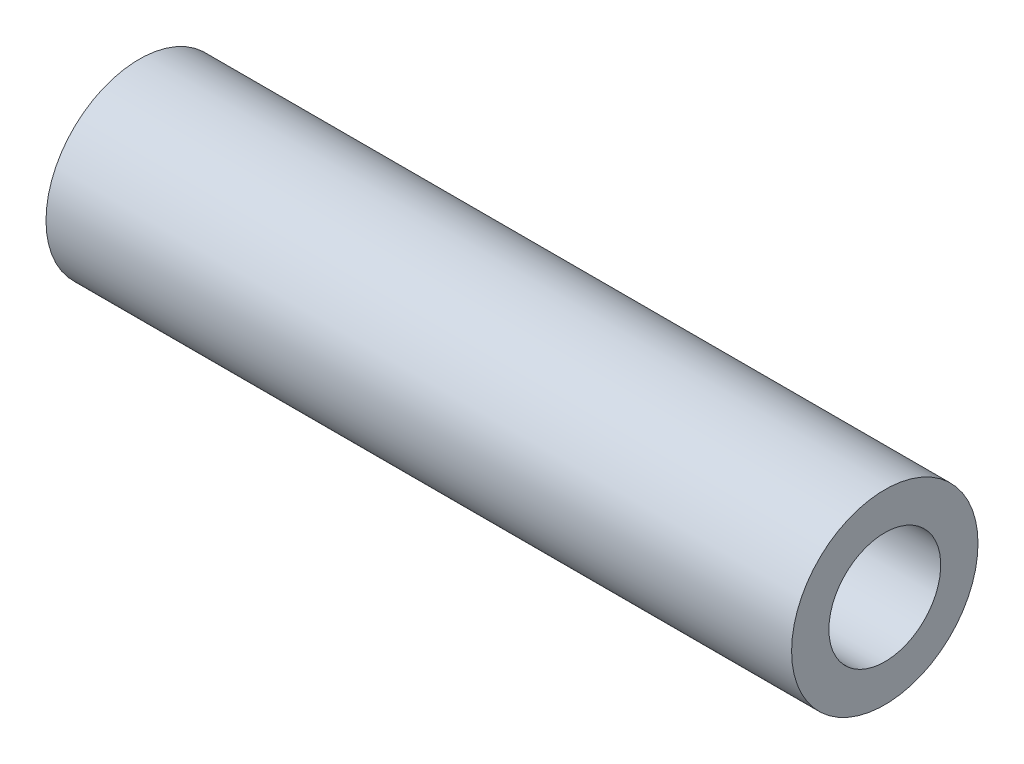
ISO-10303-21;
HEADER;
FILE_DESCRIPTION(('STEP AP214'),'2;1');
FILE_NAME('part.step','',(''),(''),'','','');
FILE_SCHEMA(('AUTOMOTIVE_DESIGN { 1 0 10303 214 1 1 1 1 }'));
ENDSEC;
DATA;
#1=APPLICATION_CONTEXT('core data for automotive mechanical design processes');
#2=APPLICATION_PROTOCOL_DEFINITION('international standard','automotive_design',2000,#1);
#3=PRODUCT_CONTEXT('',#1,'mechanical');
#4=PRODUCT('Part','Part','',(#3));
#5=PRODUCT_RELATED_PRODUCT_CATEGORY('part','',(#4));
#6=PRODUCT_DEFINITION_FORMATION('','',#4);
#7=PRODUCT_DEFINITION_CONTEXT('part definition',#1,'design');
#8=PRODUCT_DEFINITION('design','',#6,#7);
#9=PRODUCT_DEFINITION_SHAPE('','',#8);
#10=(LENGTH_UNIT() NAMED_UNIT(*) SI_UNIT(.MILLI.,.METRE.));
#11=(NAMED_UNIT(*) PLANE_ANGLE_UNIT() SI_UNIT($,.RADIAN.));
#12=(NAMED_UNIT(*) SI_UNIT($,.STERADIAN.) SOLID_ANGLE_UNIT());
#13=UNCERTAINTY_MEASURE_WITH_UNIT(LENGTH_MEASURE(1.E-05),#10,'distance_accuracy_value','');
#14=(GEOMETRIC_REPRESENTATION_CONTEXT(3) GLOBAL_UNCERTAINTY_ASSIGNED_CONTEXT((#13)) GLOBAL_UNIT_ASSIGNED_CONTEXT((#10,
#11,#12)) REPRESENTATION_CONTEXT('',''));
#15=CARTESIAN_POINT('',(0.,0.,0.));
#16=DIRECTION('',(0.,0.,1.));
#17=DIRECTION('',(1.,0.,0.));
#18=AXIS2_PLACEMENT_3D('',#15,#16,#17);
#19=CARTESIAN_POINT('',(0.,4.99999999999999,0.));
#20=DIRECTION('',(1.,0.,0.));
#21=DIRECTION('',(0.,0.,-1.));
#22=AXIS2_PLACEMENT_3D('',#19,#20,#21);
#23=PLANE('',#22);
#24=CARTESIAN_POINT('',(0.,-7.5,0.));
#25=DIRECTION('',(-1.,0.,0.));
#26=DIRECTION('',(0.,0.,1.));
#27=AXIS2_PLACEMENT_3D('',#24,#25,#26);
#28=CIRCLE('',#27,7.5);
#29=CARTESIAN_POINT('',(0.,-7.5,7.5));
#30=VERTEX_POINT('',#29);
#31=EDGE_CURVE('E10',#30,#30,#28,.T.);
#32=ORIENTED_EDGE('',*,*,#31,.F.);
#33=EDGE_LOOP('',(#32));
#34=FACE_BOUND('',#33,.T.);
#35=CARTESIAN_POINT('',(0.,-7.5,0.));
#36=DIRECTION('',(-1.,0.,0.));
#37=DIRECTION('',(0.,0.,1.));
#38=AXIS2_PLACEMENT_3D('',#35,#36,#37);
#39=CIRCLE('',#38,12.5);
#40=CARTESIAN_POINT('',(0.,-7.5,12.5));
#41=VERTEX_POINT('',#40);
#42=EDGE_CURVE('E43',#41,#41,#39,.T.);
#43=ORIENTED_EDGE('',*,*,#42,.T.);
#44=EDGE_LOOP('',(#43));
#45=FACE_BOUND('',#44,.T.);
#46=ADVANCED_FACE('F29',(#34,#45),#23,.F.);
#47=CARTESIAN_POINT('',(0.,-7.5,0.));
#48=DIRECTION('',(-1.,0.,0.));
#49=DIRECTION('',(0.,0.,1.));
#50=AXIS2_PLACEMENT_3D('',#47,#48,#49);
#51=CYLINDRICAL_SURFACE('',#50,7.5);
#52=CARTESIAN_POINT('',(100.,-7.5,0.));
#53=DIRECTION('',(-1.,0.,0.));
#54=DIRECTION('',(0.,0.,1.));
#55=AXIS2_PLACEMENT_3D('',#52,#53,#54);
#56=CIRCLE('',#55,7.5);
#57=CARTESIAN_POINT('',(100.,-7.5,7.5));
#58=VERTEX_POINT('',#57);
#59=EDGE_CURVE('E35',#58,#58,#56,.T.);
#60=ORIENTED_EDGE('',*,*,#59,.F.);
#61=EDGE_LOOP('',(#60));
#62=FACE_BOUND('',#61,.T.);
#63=ORIENTED_EDGE('',*,*,#31,.T.);
#64=EDGE_LOOP('',(#63));
#65=FACE_BOUND('',#64,.T.);
#66=ADVANCED_FACE('F58',(#62,#65),#51,.F.);
#67=CARTESIAN_POINT('',(100.,0.,0.));
#68=DIRECTION('',(-1.,0.,0.));
#69=DIRECTION('',(0.,0.,1.));
#70=AXIS2_PLACEMENT_3D('',#67,#68,#69);
#71=PLANE('',#70);
#72=CARTESIAN_POINT('',(100.,-7.5,0.));
#73=DIRECTION('',(-1.,0.,0.));
#74=DIRECTION('',(0.,0.,1.));
#75=AXIS2_PLACEMENT_3D('',#72,#73,#74);
#76=CIRCLE('',#75,12.5);
#77=CARTESIAN_POINT('',(100.,-7.5,12.5));
#78=VERTEX_POINT('',#77);
#79=EDGE_CURVE('E39',#78,#78,#76,.T.);
#80=ORIENTED_EDGE('',*,*,#79,.F.);
#81=EDGE_LOOP('',(#80));
#82=FACE_BOUND('',#81,.T.);
#83=ORIENTED_EDGE('',*,*,#59,.T.);
#84=EDGE_LOOP('',(#83));
#85=FACE_BOUND('',#84,.T.);
#86=ADVANCED_FACE('F53',(#82,#85),#71,.F.);
#87=CARTESIAN_POINT('',(0.,-7.5,0.));
#88=DIRECTION('',(-1.,0.,0.));
#89=DIRECTION('',(0.,0.,1.));
#90=AXIS2_PLACEMENT_3D('',#87,#88,#89);
#91=CYLINDRICAL_SURFACE('',#90,12.5);
#92=ORIENTED_EDGE('',*,*,#42,.F.);
#93=EDGE_LOOP('',(#92));
#94=FACE_BOUND('',#93,.T.);
#95=ORIENTED_EDGE('',*,*,#79,.T.);
#96=EDGE_LOOP('',(#95));
#97=FACE_BOUND('',#96,.T.);
#98=ADVANCED_FACE('F50',(#94,#97),#91,.T.);
#99=CLOSED_SHELL('',(#46,#66,#86,#98));
#100=MANIFOLD_SOLID_BREP('B2',#99);
#101=ADVANCED_BREP_SHAPE_REPRESENTATION('',(#18,#100),#14);
#102=SHAPE_DEFINITION_REPRESENTATION(#9,#101);
ENDSEC;
END-ISO-10303-21;
